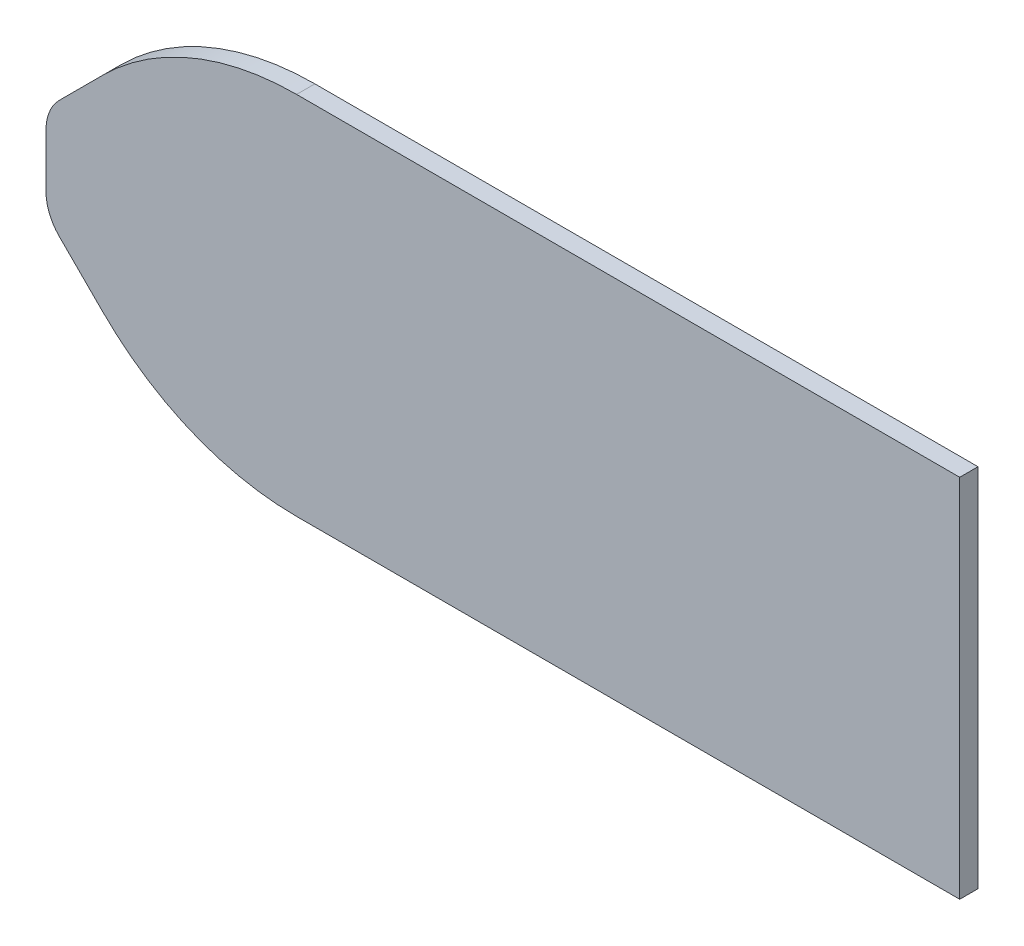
from build123d import *

# Parameters (mm, degrees)
BOSS_EXTRUDE1_DEPTH = 4


with BuildPart() as part:
    # Sketch1 → Boss-Extrude1 (new body)
    with BuildSketch(Plane.XY):
        with BuildLine():
            Line((-97.071067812, 12.928932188), (-87.573593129, 22.426406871))
            ThreePointArc((-87.573593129, 22.426406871), (-68.1081922, 35.432771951), (-45.147186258, 40))
            Line((-45.147186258, 40), (100, 40))
            Line((100, 40), (100, -40))
            Line((100, -40), (-45.147186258, -40))
            ThreePointArc((-45.147186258, -40), (-68.1081922, -35.432771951), (-87.573593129, -22.426406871))
            Line((-87.573593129, -22.426406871), (-97.071067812, -12.928932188))
            ThreePointArc((-97.071067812, -12.928932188), (-99.238795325, -9.6846987), (-100, -5.857864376))
            Line((-100, -5.857864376), (-100, 5.857864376))
            ThreePointArc((-100, 5.857864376), (-99.238795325, 9.6846987), (-97.071067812, 12.928932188))
        make_face()
    extrude(amount=BOSS_EXTRUDE1_DEPTH)


solid = part.part
